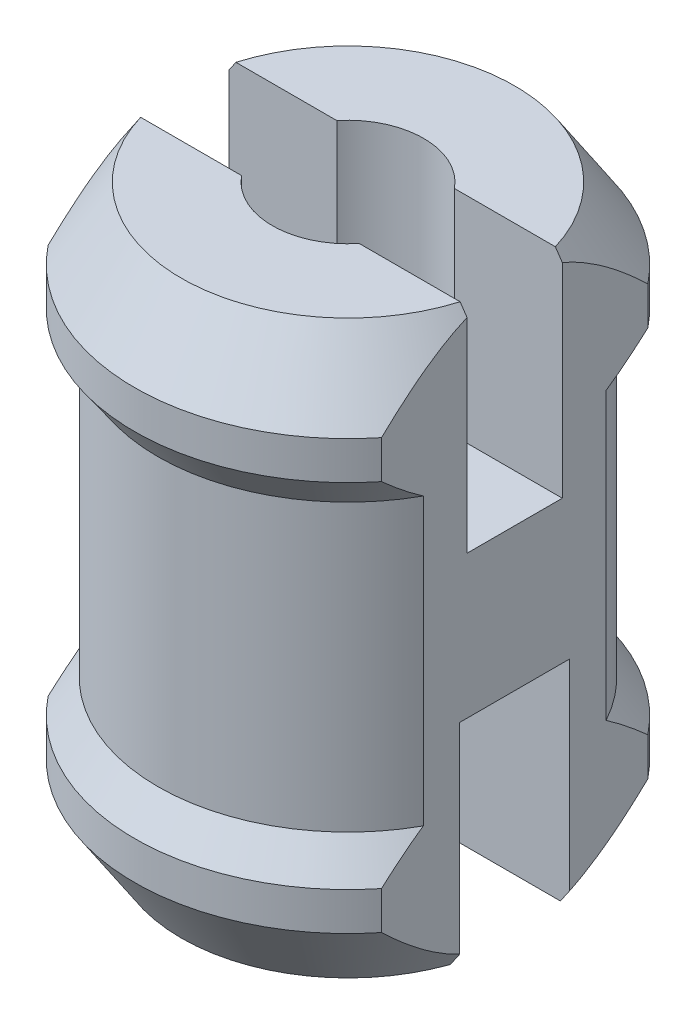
from build123d import *

# Parameters (mm, degrees)
CUT_EXTRUDE3_DEPTH = 36.6670518
CUT_EXTRUDE4_START = -4.5
CUT_EXTRUDE4_DEPTH = 4.5
SKETCH9_W          = 11.711931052
SKETCH9_H          = 2.309958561
CUT_EXTRUDE5_DEPTH = 4.5


with BuildPart() as part:
    # Sketch6 → Revolve1 (revolve)
    with BuildSketch(Plane.XY.offset(17.93281953), mode=Mode.PRIVATE) as revolve1_sk:
        Polygon((-16.055926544, 14.5), (-17.035978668, 16), (-18.946973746, 16), (-18.946973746, 11.5), (-20.535978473, 11.5), (-20.535978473, 8.5), (-18.946973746, 8.5), (-18.946973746, 4), (-17.035978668, 4), (-16.055926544, 5.5), (-16.055926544, 6.3), (-16.544238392, 7), (-16.544238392, 13), (-16.055926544, 13.7), align=None)
    revolve(revolve1_sk.sketch.rotate(Axis((-20.535978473, 11.5, 17.93281953), (0, -1, 0)), 90), axis=Axis((-20.535978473, 11.5, 17.93281953), (0, -1, 0)))

    # Sketch7 → Cut-Extrude3 (cut, through all)
    with BuildSketch(Plane(origin=(0, 16, 0), x_dir=(1, 0, 0), z_dir=(0, 1, 0))):
        with BuildLine():
            ThreePointArc((-24.035978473, -20.72940053), (-24.570755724, -19.879981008), (-24.902998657, -18.93281953))
            ThreePointArc((-24.902998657, -18.93281953), (-25.016030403, -17.93281953), (-24.902998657, -16.93281953))
            ThreePointArc((-24.902998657, -16.93281953), (-24.570755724, -15.985658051), (-24.035978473, -15.13623853))
            Line((-24.035978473, -15.13623853), (-24.035978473, -12.226683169))
            Line((-24.035978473, -12.226683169), (-25.751729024, -12.226683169))
            Line((-25.751729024, -12.226683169), (-25.751729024, -25.481580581))
            Line((-25.751729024, -25.481580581), (-24.035978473, -25.481580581))
            Line((-24.035978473, -25.481580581), (-24.035978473, -20.72940053))
        make_face()
        with BuildLine():
            ThreePointArc((-16.168958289, -18.93281953), (-16.501201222, -19.879981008), (-17.035978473, -20.72940053))
            Line((-17.035978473, -20.72940053), (-17.035978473, -25.481580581))
            Line((-17.035978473, -25.481580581), (-15.320227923, -25.481580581))
            Line((-15.320227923, -25.481580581), (-15.320227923, -12.226683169))
            Line((-15.320227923, -12.226683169), (-17.035978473, -12.226683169))
            Line((-17.035978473, -12.226683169), (-17.035978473, -15.13623853))
            ThreePointArc((-17.035978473, -15.13623853), (-16.501201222, -15.985658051), (-16.168958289, -16.93281953))
            ThreePointArc((-16.168958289, -16.93281953), (-16.084274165, -17.429635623), (-16.055926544, -17.93281953))
            ThreePointArc((-16.055926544, -17.93281953), (-16.084274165, -18.436003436), (-16.168958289, -18.93281953))
        make_face()
        with BuildLine():
            Line((-24.035978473, -18.93281953), (-24.902998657, -18.93281953))
            ThreePointArc((-24.902998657, -18.93281953), (-24.570755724, -19.879981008), (-24.035978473, -20.72940053))
            Line((-24.035978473, -20.72940053), (-24.035978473, -18.93281953))
        make_face()
        with BuildLine():
            ThreePointArc((-16.168958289, -16.93281953), (-16.501201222, -15.985658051), (-17.035978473, -15.13623853))
            Line((-17.035978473, -15.13623853), (-17.035978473, -16.93281953))
            Line((-17.035978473, -16.93281953), (-16.168958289, -16.93281953))
        make_face()
        with BuildLine():
            Line((-17.035978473, -17.93281953), (-17.035978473, -18.93281953))
            Line((-17.035978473, -18.93281953), (-16.168958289, -18.93281953))
            ThreePointArc((-16.168958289, -18.93281953), (-16.084274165, -18.436003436), (-16.055926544, -17.93281953))
            ThreePointArc((-16.055926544, -17.93281953), (-16.084274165, -17.429635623), (-16.168958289, -16.93281953))
            Line((-16.168958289, -16.93281953), (-17.035978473, -16.93281953))
            Line((-17.035978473, -16.93281953), (-17.035978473, -17.93281953))
        make_face()
        with BuildLine():
            Line((-17.035978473, -18.93281953), (-17.035978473, -20.72940053))
            ThreePointArc((-17.035978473, -20.72940053), (-16.501201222, -19.879981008), (-16.168958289, -18.93281953))
            Line((-16.168958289, -18.93281953), (-17.035978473, -18.93281953))
        make_face()
        with BuildLine():
            ThreePointArc((-24.902998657, -16.93281953), (-25.016030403, -17.93281953), (-24.902998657, -18.93281953))
            Line((-24.902998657, -18.93281953), (-24.035978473, -18.93281953))
            Line((-24.035978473, -18.93281953), (-24.035978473, -17.93281953))
            Line((-24.035978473, -17.93281953), (-24.035978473, -16.93281953))
            Line((-24.035978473, -16.93281953), (-24.902998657, -16.93281953))
        make_face()
        with BuildLine():
            ThreePointArc((-24.035978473, -15.13623853), (-24.570755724, -15.985658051), (-24.902998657, -16.93281953))
            Line((-24.902998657, -16.93281953), (-24.035978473, -16.93281953))
            Line((-24.035978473, -16.93281953), (-24.035978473, -15.13623853))
        make_face()
    extrude(amount=-CUT_EXTRUDE3_DEPTH, mode=Mode.SUBTRACT)

    # Sketch8 → Cut-Extrude4 (cut)
    with BuildSketch(Plane(origin=(0, 16, 0), x_dir=(1, 0, 0), z_dir=(0, 1, 0)).offset(CUT_EXTRUDE4_START)):
        with BuildLine():
            Line((-23.890080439, -16.93281953), (-24.902998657, -16.93281953))
            Line((-24.902998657, -16.93281953), (-24.902998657, -18.93281953))
            Line((-24.902998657, -18.93281953), (-23.890080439, -18.93281953))
            ThreePointArc((-23.890080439, -18.93281953), (-23.999311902, -18.438113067), (-24.035978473, -17.93281953))
            ThreePointArc((-24.035978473, -17.93281953), (-23.999311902, -17.427525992), (-23.890080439, -16.93281953))
        make_face()
        with BuildLine():
            Line((-21.770861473, -16.93281953), (-23.890080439, -16.93281953))
            ThreePointArc((-23.890080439, -16.93281953), (-23.999311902, -17.427525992), (-24.035978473, -17.93281953))
            ThreePointArc((-24.035978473, -17.93281953), (-23.999311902, -18.438113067), (-23.890080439, -18.93281953))
            Line((-23.890080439, -18.93281953), (-21.770861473, -18.93281953))
            ThreePointArc((-21.770861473, -18.93281953), (-22.124983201, -17.93281953), (-21.770861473, -16.93281953))
        make_face()
        with BuildLine():
            ThreePointArc((-17.035978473, -17.93281953), (-17.072645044, -17.427525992), (-17.181876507, -16.93281953))
            Line((-17.181876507, -16.93281953), (-19.301095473, -16.93281953))
            ThreePointArc((-19.301095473, -16.93281953), (-19.038118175, -17.402394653), (-18.946973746, -17.93281953))
            ThreePointArc((-18.946973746, -17.93281953), (-19.038118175, -18.463244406), (-19.301095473, -18.93281953))
            Line((-19.301095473, -18.93281953), (-17.181876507, -18.93281953))
            ThreePointArc((-17.181876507, -18.93281953), (-17.072645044, -18.438113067), (-17.035978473, -17.93281953))
        make_face()
        with BuildLine():
            Line((-19.301095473, -16.93281953), (-21.770861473, -16.93281953))
            ThreePointArc((-21.770861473, -16.93281953), (-22.124983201, -17.93281953), (-21.770861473, -18.93281953))
            Line((-21.770861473, -18.93281953), (-19.301095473, -18.93281953))
            ThreePointArc((-19.301095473, -18.93281953), (-19.038118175, -18.463244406), (-18.946973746, -17.93281953))
            ThreePointArc((-18.946973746, -17.93281953), (-19.038118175, -17.402394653), (-19.301095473, -16.93281953))
        make_face()
        with BuildLine():
            Line((-21.770861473, -16.93281953), (-23.890080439, -16.93281953))
            ThreePointArc((-23.890080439, -16.93281953), (-23.999311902, -17.427525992), (-24.035978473, -17.93281953))
            ThreePointArc((-24.035978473, -17.93281953), (-23.999311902, -18.438113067), (-23.890080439, -18.93281953))
            Line((-23.890080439, -18.93281953), (-21.770861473, -18.93281953))
            ThreePointArc((-21.770861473, -18.93281953), (-22.124983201, -17.93281953), (-21.770861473, -16.93281953))
        make_face()
        with BuildLine():
            ThreePointArc((-17.035978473, -17.93281953), (-17.072645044, -17.427525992), (-17.181876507, -16.93281953))
            Line((-17.181876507, -16.93281953), (-19.301095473, -16.93281953))
            ThreePointArc((-19.301095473, -16.93281953), (-19.038118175, -17.402394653), (-18.946973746, -17.93281953))
            ThreePointArc((-18.946973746, -17.93281953), (-19.038118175, -18.463244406), (-19.301095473, -18.93281953))
            Line((-19.301095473, -18.93281953), (-17.181876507, -18.93281953))
            ThreePointArc((-17.181876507, -18.93281953), (-17.072645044, -18.438113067), (-17.035978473, -17.93281953))
        make_face()
        with BuildLine():
            Line((-16.168958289, -16.93281953), (-17.181876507, -16.93281953))
            ThreePointArc((-17.181876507, -16.93281953), (-17.072645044, -17.427525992), (-17.035978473, -17.93281953))
            ThreePointArc((-17.035978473, -17.93281953), (-17.072645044, -18.438113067), (-17.181876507, -18.93281953))
            Line((-17.181876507, -18.93281953), (-16.168958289, -18.93281953))
            Line((-16.168958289, -18.93281953), (-16.168958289, -16.93281953))
        make_face()
    extrude(amount=CUT_EXTRUDE4_DEPTH, mode=Mode.SUBTRACT)

    # Sketch9 → Cut-Extrude5 (cut)
    with BuildSketch(Plane.XZ.offset(-4)):
        with Locations((-20.200101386, 17.93281953)):
            Rectangle(SKETCH9_W, SKETCH9_H)
    extrude(amount=-CUT_EXTRUDE5_DEPTH, mode=Mode.SUBTRACT)


solid = part.part
